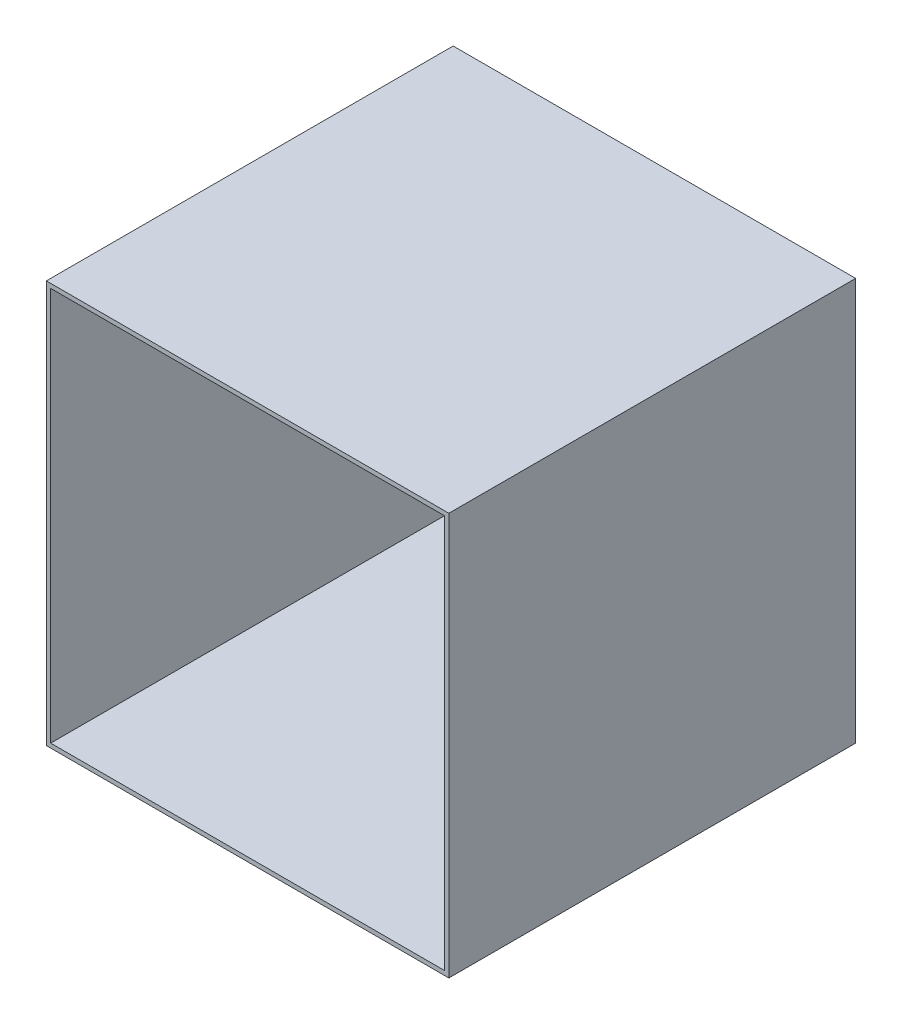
ISO-10303-21;
HEADER;
FILE_DESCRIPTION(('STEP AP214'),'2;1');
FILE_NAME('part.step','',(''),(''),'','','');
FILE_SCHEMA(('AUTOMOTIVE_DESIGN { 1 0 10303 214 1 1 1 1 }'));
ENDSEC;
DATA;
#1=APPLICATION_CONTEXT('core data for automotive mechanical design processes');
#2=APPLICATION_PROTOCOL_DEFINITION('international standard','automotive_design',2000,#1);
#3=PRODUCT_CONTEXT('',#1,'mechanical');
#4=PRODUCT('Part','Part','',(#3));
#5=PRODUCT_RELATED_PRODUCT_CATEGORY('part','',(#4));
#6=PRODUCT_DEFINITION_FORMATION('','',#4);
#7=PRODUCT_DEFINITION_CONTEXT('part definition',#1,'design');
#8=PRODUCT_DEFINITION('design','',#6,#7);
#9=PRODUCT_DEFINITION_SHAPE('','',#8);
#10=(LENGTH_UNIT() NAMED_UNIT(*) SI_UNIT(.MILLI.,.METRE.));
#11=(NAMED_UNIT(*) PLANE_ANGLE_UNIT() SI_UNIT($,.RADIAN.));
#12=(NAMED_UNIT(*) SI_UNIT($,.STERADIAN.) SOLID_ANGLE_UNIT());
#13=UNCERTAINTY_MEASURE_WITH_UNIT(LENGTH_MEASURE(1.E-05),#10,'distance_accuracy_value','');
#14=(GEOMETRIC_REPRESENTATION_CONTEXT(3) GLOBAL_UNCERTAINTY_ASSIGNED_CONTEXT((#13)) GLOBAL_UNIT_ASSIGNED_CONTEXT((#10,
#11,#12)) REPRESENTATION_CONTEXT('',''));
#15=CARTESIAN_POINT('',(0.,0.,0.));
#16=DIRECTION('',(0.,0.,1.));
#17=DIRECTION('',(1.,0.,0.));
#18=AXIS2_PLACEMENT_3D('',#15,#16,#17);
#19=CARTESIAN_POINT('',(139.7,139.7,3.));
#20=DIRECTION('',(0.,-1.,0.));
#21=DIRECTION('',(0.,0.,-1.));
#22=AXIS2_PLACEMENT_3D('',#19,#20,#21);
#23=PLANE('',#22);
#24=DIRECTION('',(-1.,0.,0.));
#25=VECTOR('',#24,1.);
#26=CARTESIAN_POINT('',(139.7,139.7,0.));
#27=LINE('',#26,#25);
#28=CARTESIAN_POINT('',(139.7,139.7,0.));
#29=VERTEX_POINT('',#28);
#30=CARTESIAN_POINT('',(-139.7,139.7,0.));
#31=VERTEX_POINT('',#30);
#32=EDGE_CURVE('E182',#29,#31,#27,.T.);
#33=ORIENTED_EDGE('',*,*,#32,.T.);
#34=DIRECTION('',(0.,0.,-1.));
#35=VECTOR('',#34,1.);
#36=CARTESIAN_POINT('',(-139.7,139.7,3.));
#37=LINE('',#36,#35);
#38=CARTESIAN_POINT('',(-139.7,139.7,282.4));
#39=VERTEX_POINT('',#38);
#40=EDGE_CURVE('E11',#39,#31,#37,.T.);
#41=ORIENTED_EDGE('',*,*,#40,.F.);
#42=DIRECTION('',(-1.,0.,0.));
#43=VECTOR('',#42,1.);
#44=CARTESIAN_POINT('',(-139.7,139.7,282.4));
#45=LINE('',#44,#43);
#46=CARTESIAN_POINT('',(139.7,139.7,282.4));
#47=VERTEX_POINT('',#46);
#48=EDGE_CURVE('E170',#47,#39,#45,.T.);
#49=ORIENTED_EDGE('',*,*,#48,.F.);
#50=DIRECTION('',(0.,0.,-1.));
#51=VECTOR('',#50,1.);
#52=CARTESIAN_POINT('',(139.7,139.7,3.));
#53=LINE('',#52,#51);
#54=EDGE_CURVE('E194',#47,#29,#53,.T.);
#55=ORIENTED_EDGE('',*,*,#54,.T.);
#56=EDGE_LOOP('',(#33,#41,#49,#55));
#57=FACE_BOUND('',#56,.T.);
#58=ADVANCED_FACE('F47',(#57),#23,.F.);
#59=CARTESIAN_POINT('',(-139.7,-139.7,3.));
#60=DIRECTION('',(1.,0.,0.));
#61=DIRECTION('',(0.,0.,-1.));
#62=AXIS2_PLACEMENT_3D('',#59,#60,#61);
#63=PLANE('',#62);
#64=DIRECTION('',(0.,-1.,0.));
#65=VECTOR('',#64,1.);
#66=CARTESIAN_POINT('',(-139.7,-139.7,0.));
#67=LINE('',#66,#65);
#68=CARTESIAN_POINT('',(-139.7,-139.7,0.));
#69=VERTEX_POINT('',#68);
#70=EDGE_CURVE('E186',#31,#69,#67,.T.);
#71=ORIENTED_EDGE('',*,*,#70,.T.);
#72=DIRECTION('',(0.,0.,-1.));
#73=VECTOR('',#72,1.);
#74=CARTESIAN_POINT('',(-139.7,-139.7,3.));
#75=LINE('',#74,#73);
#76=CARTESIAN_POINT('',(-139.7,-139.7,282.4));
#77=VERTEX_POINT('',#76);
#78=EDGE_CURVE('E55',#77,#69,#75,.T.);
#79=ORIENTED_EDGE('',*,*,#78,.F.);
#80=DIRECTION('',(0.,-1.,0.));
#81=VECTOR('',#80,1.);
#82=CARTESIAN_POINT('',(-139.7,-139.7,282.4));
#83=LINE('',#82,#81);
#84=EDGE_CURVE('E174',#39,#77,#83,.T.);
#85=ORIENTED_EDGE('',*,*,#84,.F.);
#86=ORIENTED_EDGE('',*,*,#40,.T.);
#87=EDGE_LOOP('',(#71,#79,#85,#86));
#88=FACE_BOUND('',#87,.T.);
#89=ADVANCED_FACE('F216',(#88),#63,.F.);
#90=CARTESIAN_POINT('',(139.7,-139.7,3.));
#91=DIRECTION('',(0.,1.,0.));
#92=DIRECTION('',(0.,0.,1.));
#93=AXIS2_PLACEMENT_3D('',#90,#91,#92);
#94=PLANE('',#93);
#95=DIRECTION('',(1.,0.,0.));
#96=VECTOR('',#95,1.);
#97=CARTESIAN_POINT('',(139.7,-139.7,0.));
#98=LINE('',#97,#96);
#99=CARTESIAN_POINT('',(139.7,-139.7,0.));
#100=VERTEX_POINT('',#99);
#101=EDGE_CURVE('E189',#69,#100,#98,.T.);
#102=ORIENTED_EDGE('',*,*,#101,.T.);
#103=DIRECTION('',(0.,0.,-1.));
#104=VECTOR('',#103,1.);
#105=CARTESIAN_POINT('',(139.7,-139.7,3.));
#106=LINE('',#105,#104);
#107=CARTESIAN_POINT('',(139.7,-139.7,282.4));
#108=VERTEX_POINT('',#107);
#109=EDGE_CURVE('E197',#108,#100,#106,.T.);
#110=ORIENTED_EDGE('',*,*,#109,.F.);
#111=DIRECTION('',(1.,0.,0.));
#112=VECTOR('',#111,1.);
#113=CARTESIAN_POINT('',(-139.7,-139.7,282.4));
#114=LINE('',#113,#112);
#115=EDGE_CURVE('E178',#77,#108,#114,.T.);
#116=ORIENTED_EDGE('',*,*,#115,.F.);
#117=ORIENTED_EDGE('',*,*,#78,.T.);
#118=EDGE_LOOP('',(#102,#110,#116,#117));
#119=FACE_BOUND('',#118,.T.);
#120=ADVANCED_FACE('F205',(#119),#94,.F.);
#121=CARTESIAN_POINT('',(139.7,-139.7,3.));
#122=DIRECTION('',(-1.,0.,0.));
#123=DIRECTION('',(0.,0.,1.));
#124=AXIS2_PLACEMENT_3D('',#121,#122,#123);
#125=PLANE('',#124);
#126=DIRECTION('',(0.,1.,0.));
#127=VECTOR('',#126,1.);
#128=CARTESIAN_POINT('',(139.7,-139.7,0.));
#129=LINE('',#128,#127);
#130=EDGE_CURVE('E70',#100,#29,#129,.T.);
#131=ORIENTED_EDGE('',*,*,#130,.T.);
#132=ORIENTED_EDGE('',*,*,#54,.F.);
#133=DIRECTION('',(0.,1.,0.));
#134=VECTOR('',#133,1.);
#135=CARTESIAN_POINT('',(139.7,-139.7,282.4));
#136=LINE('',#135,#134);
#137=EDGE_CURVE('E132',#108,#47,#136,.T.);
#138=ORIENTED_EDGE('',*,*,#137,.F.);
#139=ORIENTED_EDGE('',*,*,#109,.T.);
#140=EDGE_LOOP('',(#131,#132,#138,#139));
#141=FACE_BOUND('',#140,.T.);
#142=ADVANCED_FACE('F214',(#141),#125,.F.);
#143=CARTESIAN_POINT('',(0.,0.,0.));
#144=DIRECTION('',(0.,0.,-1.));
#145=DIRECTION('',(-1.,0.,0.));
#146=AXIS2_PLACEMENT_3D('',#143,#144,#145);
#147=PLANE('',#146);
#148=ORIENTED_EDGE('',*,*,#32,.F.);
#149=ORIENTED_EDGE('',*,*,#130,.F.);
#150=ORIENTED_EDGE('',*,*,#101,.F.);
#151=ORIENTED_EDGE('',*,*,#70,.F.);
#152=EDGE_LOOP('',(#148,#149,#150,#151));
#153=FACE_BOUND('',#152,.T.);
#154=ADVANCED_FACE('F210',(#153),#147,.T.);
#155=CARTESIAN_POINT('',(0.,0.,282.4));
#156=DIRECTION('',(0.,0.,-1.));
#157=DIRECTION('',(-1.,0.,0.));
#158=AXIS2_PLACEMENT_3D('',#155,#156,#157);
#159=PLANE('',#158);
#160=ORIENTED_EDGE('',*,*,#137,.T.);
#161=ORIENTED_EDGE('',*,*,#48,.T.);
#162=ORIENTED_EDGE('',*,*,#84,.T.);
#163=ORIENTED_EDGE('',*,*,#115,.T.);
#164=EDGE_LOOP('',(#160,#161,#162,#163));
#165=FACE_BOUND('',#164,.T.);
#166=DIRECTION('',(0.,1.,0.));
#167=VECTOR('',#166,1.);
#168=CARTESIAN_POINT('',(136.7,-136.7,282.4));
#169=LINE('',#168,#167);
#170=CARTESIAN_POINT('',(136.7,-136.7,282.4));
#171=VERTEX_POINT('',#170);
#172=CARTESIAN_POINT('',(136.7,136.7,282.4));
#173=VERTEX_POINT('',#172);
#174=EDGE_CURVE('E114',#171,#173,#169,.T.);
#175=ORIENTED_EDGE('',*,*,#174,.F.);
#176=DIRECTION('',(1.,0.,0.));
#177=VECTOR('',#176,1.);
#178=CARTESIAN_POINT('',(-136.7,-136.7,282.4));
#179=LINE('',#178,#177);
#180=CARTESIAN_POINT('',(-136.7,-136.7,282.4));
#181=VERTEX_POINT('',#180);
#182=EDGE_CURVE('E143',#181,#171,#179,.T.);
#183=ORIENTED_EDGE('',*,*,#182,.F.);
#184=DIRECTION('',(0.,-1.,0.));
#185=VECTOR('',#184,1.);
#186=CARTESIAN_POINT('',(-136.7,-136.7,282.4));
#187=LINE('',#186,#185);
#188=CARTESIAN_POINT('',(-136.7,136.7,282.4));
#189=VERTEX_POINT('',#188);
#190=EDGE_CURVE('E138',#189,#181,#187,.T.);
#191=ORIENTED_EDGE('',*,*,#190,.F.);
#192=DIRECTION('',(-1.,0.,0.));
#193=VECTOR('',#192,1.);
#194=CARTESIAN_POINT('',(-136.7,136.7,282.4));
#195=LINE('',#194,#193);
#196=EDGE_CURVE('E123',#173,#189,#195,.T.);
#197=ORIENTED_EDGE('',*,*,#196,.F.);
#198=EDGE_LOOP('',(#175,#183,#191,#197));
#199=FACE_BOUND('',#198,.T.);
#200=ADVANCED_FACE('F136',(#165,#199),#159,.F.);
#201=CARTESIAN_POINT('',(136.7,-136.7,282.4));
#202=DIRECTION('',(-1.,0.,0.));
#203=DIRECTION('',(0.,0.,1.));
#204=AXIS2_PLACEMENT_3D('',#201,#202,#203);
#205=PLANE('',#204);
#206=DIRECTION('',(0.,1.,0.));
#207=VECTOR('',#206,1.);
#208=CARTESIAN_POINT('',(136.7,-136.7,3.));
#209=LINE('',#208,#207);
#210=CARTESIAN_POINT('',(136.7,-136.7,3.));
#211=VERTEX_POINT('',#210);
#212=CARTESIAN_POINT('',(136.7,136.7,3.));
#213=VERTEX_POINT('',#212);
#214=EDGE_CURVE('E148',#211,#213,#209,.T.);
#215=ORIENTED_EDGE('',*,*,#214,.F.);
#216=DIRECTION('',(0.,0.,-1.));
#217=VECTOR('',#216,1.);
#218=CARTESIAN_POINT('',(136.7,-136.7,282.4));
#219=LINE('',#218,#217);
#220=EDGE_CURVE('E62',#171,#211,#219,.T.);
#221=ORIENTED_EDGE('',*,*,#220,.F.);
#222=ORIENTED_EDGE('',*,*,#174,.T.);
#223=DIRECTION('',(0.,0.,-1.));
#224=VECTOR('',#223,1.);
#225=CARTESIAN_POINT('',(136.7,136.7,282.4));
#226=LINE('',#225,#224);
#227=EDGE_CURVE('E117',#173,#213,#226,.T.);
#228=ORIENTED_EDGE('',*,*,#227,.T.);
#229=EDGE_LOOP('',(#215,#221,#222,#228));
#230=FACE_BOUND('',#229,.T.);
#231=ADVANCED_FACE('F116',(#230),#205,.T.);
#232=CARTESIAN_POINT('',(-136.7,136.7,282.4));
#233=DIRECTION('',(0.,-1.,0.));
#234=DIRECTION('',(0.,0.,-1.));
#235=AXIS2_PLACEMENT_3D('',#232,#233,#234);
#236=PLANE('',#235);
#237=DIRECTION('',(-1.,0.,0.));
#238=VECTOR('',#237,1.);
#239=CARTESIAN_POINT('',(-136.7,136.7,3.));
#240=LINE('',#239,#238);
#241=CARTESIAN_POINT('',(-136.7,136.7,3.));
#242=VERTEX_POINT('',#241);
#243=EDGE_CURVE('E130',#213,#242,#240,.T.);
#244=ORIENTED_EDGE('',*,*,#243,.F.);
#245=ORIENTED_EDGE('',*,*,#227,.F.);
#246=ORIENTED_EDGE('',*,*,#196,.T.);
#247=DIRECTION('',(0.,0.,-1.));
#248=VECTOR('',#247,1.);
#249=CARTESIAN_POINT('',(-136.7,136.7,282.4));
#250=LINE('',#249,#248);
#251=EDGE_CURVE('E133',#189,#242,#250,.T.);
#252=ORIENTED_EDGE('',*,*,#251,.T.);
#253=EDGE_LOOP('',(#244,#245,#246,#252));
#254=FACE_BOUND('',#253,.T.);
#255=ADVANCED_FACE('F127',(#254),#236,.T.);
#256=CARTESIAN_POINT('',(-136.7,-136.7,282.4));
#257=DIRECTION('',(1.,0.,0.));
#258=DIRECTION('',(0.,0.,-1.));
#259=AXIS2_PLACEMENT_3D('',#256,#257,#258);
#260=PLANE('',#259);
#261=DIRECTION('',(0.,-1.,0.));
#262=VECTOR('',#261,1.);
#263=CARTESIAN_POINT('',(-136.7,-136.7,3.));
#264=LINE('',#263,#262);
#265=CARTESIAN_POINT('',(-136.7,-136.7,3.));
#266=VERTEX_POINT('',#265);
#267=EDGE_CURVE('E153',#242,#266,#264,.T.);
#268=ORIENTED_EDGE('',*,*,#267,.F.);
#269=ORIENTED_EDGE('',*,*,#251,.F.);
#270=ORIENTED_EDGE('',*,*,#190,.T.);
#271=DIRECTION('',(0.,0.,-1.));
#272=VECTOR('',#271,1.);
#273=CARTESIAN_POINT('',(-136.7,-136.7,282.4));
#274=LINE('',#273,#272);
#275=EDGE_CURVE('E162',#181,#266,#274,.T.);
#276=ORIENTED_EDGE('',*,*,#275,.T.);
#277=EDGE_LOOP('',(#268,#269,#270,#276));
#278=FACE_BOUND('',#277,.T.);
#279=ADVANCED_FACE('F239',(#278),#260,.T.);
#280=CARTESIAN_POINT('',(-136.7,-136.7,282.4));
#281=DIRECTION('',(0.,1.,0.));
#282=DIRECTION('',(0.,0.,1.));
#283=AXIS2_PLACEMENT_3D('',#280,#281,#282);
#284=PLANE('',#283);
#285=DIRECTION('',(1.,0.,0.));
#286=VECTOR('',#285,1.);
#287=CARTESIAN_POINT('',(-136.7,-136.7,3.));
#288=LINE('',#287,#286);
#289=EDGE_CURVE('E124',#266,#211,#288,.T.);
#290=ORIENTED_EDGE('',*,*,#289,.F.);
#291=ORIENTED_EDGE('',*,*,#275,.F.);
#292=ORIENTED_EDGE('',*,*,#182,.T.);
#293=ORIENTED_EDGE('',*,*,#220,.T.);
#294=EDGE_LOOP('',(#290,#291,#292,#293));
#295=FACE_BOUND('',#294,.T.);
#296=ADVANCED_FACE('F231',(#295),#284,.T.);
#297=CARTESIAN_POINT('',(0.,0.,3.));
#298=DIRECTION('',(0.,0.,-1.));
#299=DIRECTION('',(-1.,0.,0.));
#300=AXIS2_PLACEMENT_3D('',#297,#298,#299);
#301=PLANE('',#300);
#302=ORIENTED_EDGE('',*,*,#289,.T.);
#303=ORIENTED_EDGE('',*,*,#214,.T.);
#304=ORIENTED_EDGE('',*,*,#243,.T.);
#305=ORIENTED_EDGE('',*,*,#267,.T.);
#306=EDGE_LOOP('',(#302,#303,#304,#305));
#307=FACE_BOUND('',#306,.T.);
#308=ADVANCED_FACE('F228',(#307),#301,.F.);
#309=CLOSED_SHELL('',(#58,#89,#120,#142,#154,#200,#231,#255,#279,#296,#308));
#310=MANIFOLD_SOLID_BREP('B2',#309);
#311=ADVANCED_BREP_SHAPE_REPRESENTATION('',(#18,#310),#14);
#312=SHAPE_DEFINITION_REPRESENTATION(#9,#311);
ENDSEC;
END-ISO-10303-21;
